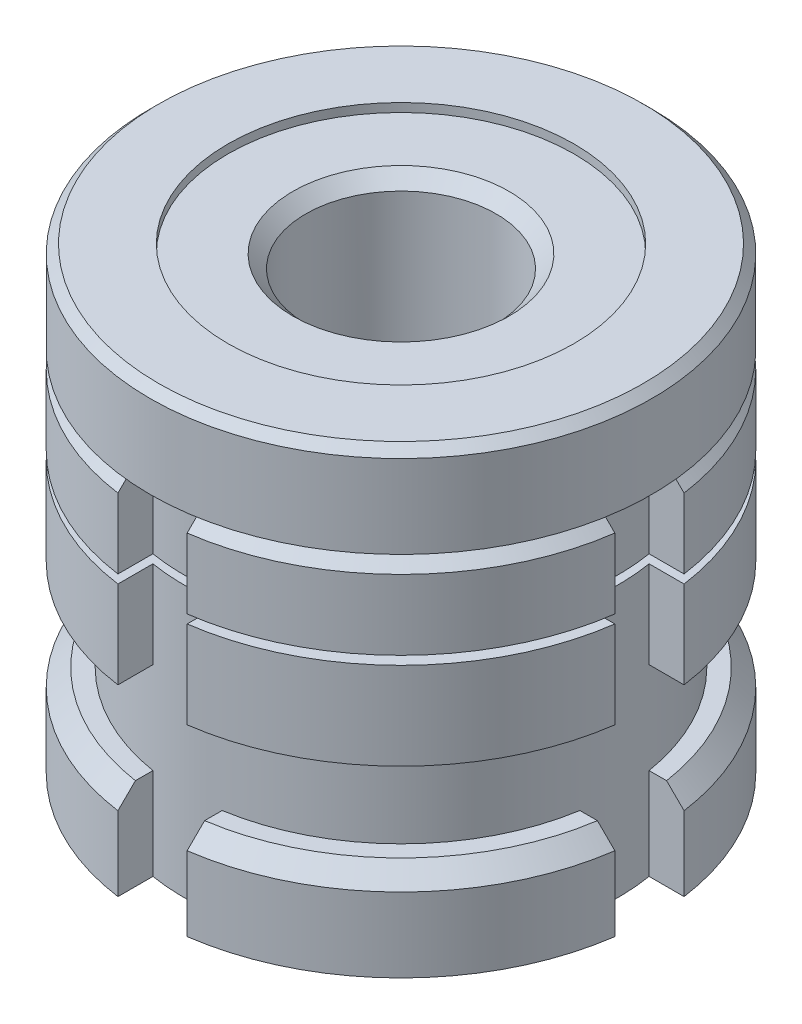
from build123d import *
from build123d.topology import SkipClean

# Parameters (mm, degrees)
SKETCH1_R           = 29
BOSS_EXTRUDE1_DEPTH = 21.2
SKETCH2_W           = 9
SKETCH2_H           = 1
SKETCH3_R           = 25
BOSS_EXTRUDE2_DEPTH = 21.2
SKETCH4_R           = 29
BOSS_EXTRUDE3_DEPTH = 10.6
CUT_EXTRUDE4_START  = -42.4
CUT_EXTRUDE4_DEPTH  = 42.4
CHAMFER1_SIZE       = 2
SKETCH6_R           = 29
BOSS_EXTRUDE4_DEPTH = 10.6
CHAMFER2_SIZE       = 1
CUT_EXTRUDE5_START  = -1
SKETCH7_R           = 20
CUT_EXTRUDE5_DEPTH  = 1
SKETCH8_R           = 11
CUT_EXTRUDE6_DEPTH  = 52
CHAMFER3_SIZE       = 1.5


with BuildPart() as part:
    # Sketch1 → Boss-Extrude1 (new body)
    with BuildSketch(Plane(origin=(0, 0, 0), x_dir=(1, 0, 0), z_dir=(0, 1, 0))):
        with Locations(Location((0, 0, 0), (0, 0, 270))):
            Circle(SKETCH1_R)
    extrude(amount=BOSS_EXTRUDE1_DEPTH)

    # Sketch2 → Cut-Revolve1 (revolve, cut)
    with BuildSketch(Plane(origin=(0, 0, 0), x_dir=(0, 0, -1), z_dir=(1, 0, 0))):
        with Locations((-24.5, 10.6)):
            Rectangle(SKETCH2_W, SKETCH2_H)
    revolve(axis=Axis((0, 13.26477, 0), (0, -1, 0)), mode=Mode.SUBTRACT)

    # Sketch3 → Boss-Extrude2 (add)
    with BuildSketch(Plane.XZ):
        with Locations(Location((0, 0, 0), (0, 0, 270))):
            Circle(SKETCH3_R)
    extrude(amount=BOSS_EXTRUDE2_DEPTH)

    # Sketch4 → Boss-Extrude3 (add)
    with BuildSketch(Plane.XZ.offset(21.2)):
        with Locations(Location((0, 0, 0), (0, 0, 90))):
            Circle(SKETCH4_R)
    extrude(amount=-BOSS_EXTRUDE3_DEPTH)

    # Sketch5 → Cut-Extrude4 (cut)
    with SkipClean():  # the faces are left unmerged after this step: merging them gives an invalid solid
        with BuildSketch(Plane(origin=(0, 21.2, 0), x_dir=(1, 0, 0), z_dir=(0, 1, 0)).offset(CUT_EXTRUDE4_START)):
            with BuildLine():
                Line((-28.722813, 4), (-24.677925, 4))
                ThreePointArc((-24.677925, 4), (-25, 0), (-24.677925, -4))
                Line((-24.677925, -4), (-28.722813, -4))
                ThreePointArc((-28.722813, -4), (-29, 0), (-28.722813, 4))
            make_face()
            with BuildLine():
                Line((-4, 28.722813), (-4, 24.677925))
                ThreePointArc((-4, 24.677925), (0, 25), (4, 24.677925))
                Line((4, 24.677925), (4, 28.722813))
                ThreePointArc((4, 28.722813), (0, 29), (-4, 28.722813))
            make_face()
            with BuildLine():
                Line((24.677925, 4), (28.722813, 4))
                ThreePointArc((28.722813, 4), (29, 0), (28.722813, -4))
                Line((28.722813, -4), (24.677925, -4))
                ThreePointArc((24.677925, -4), (25, 0), (24.677925, 4))
            make_face()
            with BuildLine():
                Line((-4, -24.677925), (-4, -28.722813))
                ThreePointArc((-4, -28.722813), (0, -29), (4, -28.722813))
                Line((4, -28.722813), (4, -24.677925))
                ThreePointArc((4, -24.677925), (0, -25), (-4, -24.677925))
            make_face()
        extrude(amount=CUT_EXTRUDE4_DEPTH, mode=Mode.SUBTRACT)

    # Chamfer1
    chamfer1_edges = [part.edges().sort_by_distance(p)[0] for p in [
        (20.506097, -10.6, -20.506097),
        (20.506097, -10.6, 20.506097),
        (-20.506097, -10.6, 20.506097),
        (-20.506097, -10.6, -20.506097),
        (20.506097, 21.2, 20.506097),
        (20.506097, 21.2, -20.506097),
        (-20.506097, 21.2, -20.506097),
        (-20.506097, 21.2, 20.506097),
    ]]
    chamfer(chamfer1_edges, length=CHAMFER1_SIZE)

    # Sketch6 → Boss-Extrude4 (add)
    with BuildSketch(Plane(origin=(0, 21.2, 0), x_dir=(1, 0, 0), z_dir=(0, 1, 0))):
        with Locations(Location((0, 0, 0), (0, 0, 270))):
            Circle(SKETCH6_R)
    extrude(amount=BOSS_EXTRUDE4_DEPTH)

    # Chamfer2
    chamfer2_edges = [part.edges().sort_by_distance(p)[0] for p in [
        (0, 31.8, -29),
    ]]
    chamfer(chamfer2_edges, length=CHAMFER2_SIZE)

    # Sketch7 → Cut-Extrude5 (cut)
    with BuildSketch(Plane(origin=(0, 31.8, 0), x_dir=(1, 0, 0), z_dir=(0, 1, 0)).offset(CUT_EXTRUDE5_START)):
        with Locations(Location((0, 0, 0), (0, 0, 270))):
            Circle(SKETCH7_R)
    extrude(amount=CUT_EXTRUDE5_DEPTH, mode=Mode.SUBTRACT)

    # Sketch8 → Cut-Extrude6 (cut)
    with BuildSketch(Plane(origin=(0, 30.8, 0), x_dir=(1, 0, 0), z_dir=(0, 1, 0))):
        with Locations(Location((0, 0, 0), (0, 0, 270))):
            Circle(SKETCH8_R)
    extrude(amount=-CUT_EXTRUDE6_DEPTH, mode=Mode.SUBTRACT)

    # Chamfer3
    chamfer3_edges = [part.edges().sort_by_distance(p)[0] for p in [
        (0, 30.8, -11),
        (0, -21.2, -11),
    ]]
    chamfer(chamfer3_edges, length=CHAMFER3_SIZE)


solid = part.part
